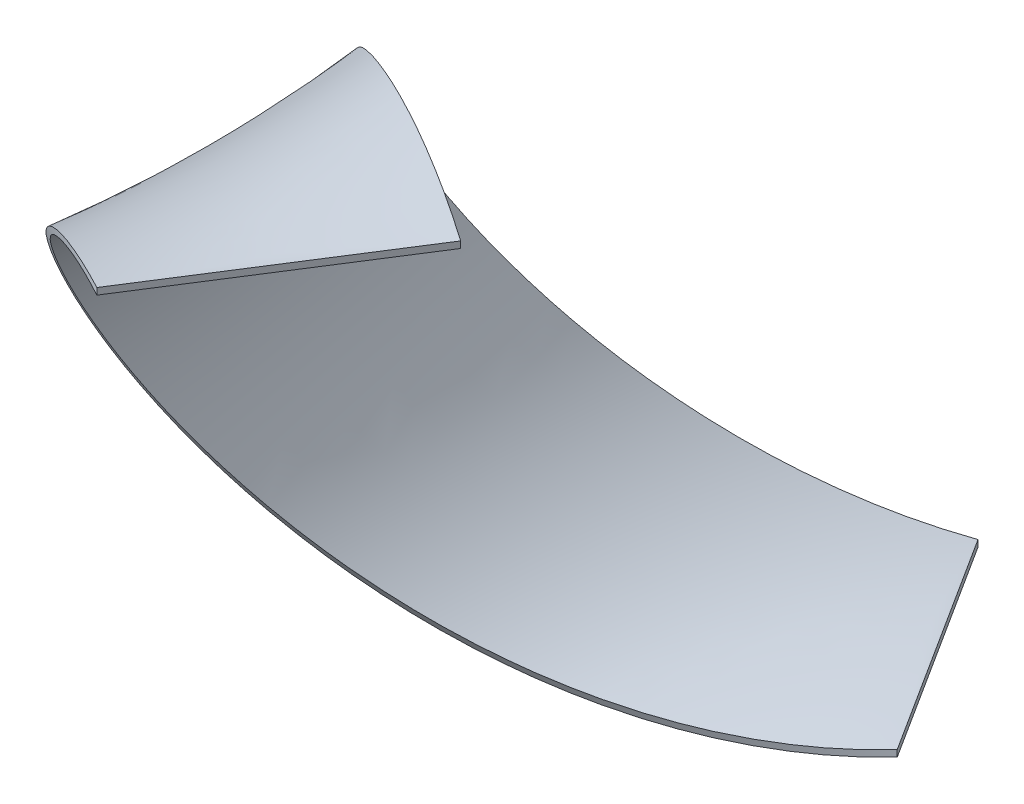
from build123d import *

# Parameters (mm, degrees)
AUSTRAGUNG1_PITCH       = 100
AUSTRAGUNG1_HEIGHT      = 50
AUSTRAGUNG1_RADIUS      = 25
AUSTRAGUNG1_START_ANGLE = -90
SKIZZE3_W               = 20
SKIZZE3_H               = 0.5


with BuildPart() as part:
    # Austragung1: sweep along a helix
    with BuildLine() as austragung1_path:
        add(Helix(AUSTRAGUNG1_PITCH, AUSTRAGUNG1_HEIGHT, AUSTRAGUNG1_RADIUS, center=(0, 0, 0), direction=(0, 0, 1), lefthand=True, mode=Mode.PRIVATE).rotate(Axis((0, 0, 0), (0, 0, 1)), AUSTRAGUNG1_START_ANGLE))
    # Skizze3 → Austragung1 (sweep)
    with BuildSketch(Plane(origin=(0, 0, 0), x_dir=(-0.5370292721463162, 0, -0.843563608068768), z_dir=(0.8435636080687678, 0, -0.5370292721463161))):
        with Locations((0, -25)):
            Rectangle(SKIZZE3_W, SKIZZE3_H)
    sweep(path=austragung1_path.line, is_frenet=True)


solid = part.part
